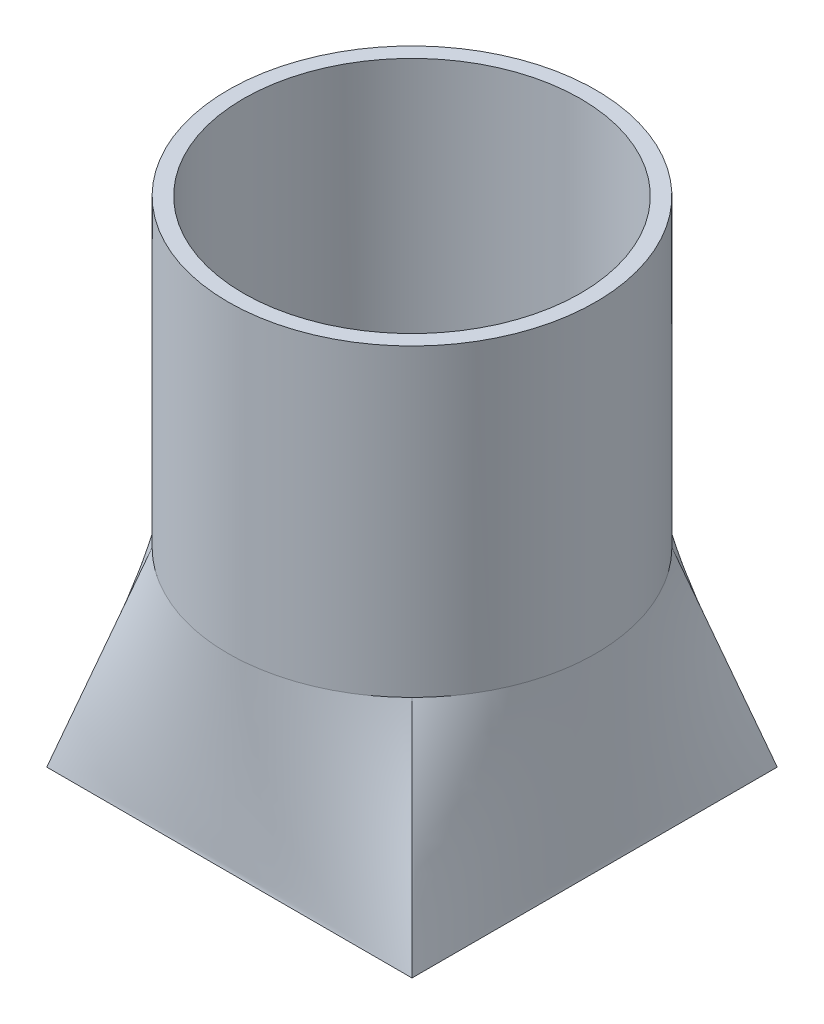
ISO-10303-21;
HEADER;
FILE_DESCRIPTION(('STEP AP214'),'2;1');
FILE_NAME('part.step','',(''),(''),'','','');
FILE_SCHEMA(('AUTOMOTIVE_DESIGN { 1 0 10303 214 1 1 1 1 }'));
ENDSEC;
DATA;
#1=APPLICATION_CONTEXT('core data for automotive mechanical design processes');
#2=APPLICATION_PROTOCOL_DEFINITION('international standard','automotive_design',2000,#1);
#3=PRODUCT_CONTEXT('',#1,'mechanical');
#4=PRODUCT('Part','Part','',(#3));
#5=PRODUCT_RELATED_PRODUCT_CATEGORY('part','',(#4));
#6=PRODUCT_DEFINITION_FORMATION('','',#4);
#7=PRODUCT_DEFINITION_CONTEXT('part definition',#1,'design');
#8=PRODUCT_DEFINITION('design','',#6,#7);
#9=PRODUCT_DEFINITION_SHAPE('','',#8);
#10=(LENGTH_UNIT() NAMED_UNIT(*) SI_UNIT(.MILLI.,.METRE.));
#11=(NAMED_UNIT(*) PLANE_ANGLE_UNIT() SI_UNIT($,.RADIAN.));
#12=(NAMED_UNIT(*) SI_UNIT($,.STERADIAN.) SOLID_ANGLE_UNIT());
#13=UNCERTAINTY_MEASURE_WITH_UNIT(LENGTH_MEASURE(1.E-05),#10,'distance_accuracy_value','');
#14=(GEOMETRIC_REPRESENTATION_CONTEXT(3) GLOBAL_UNCERTAINTY_ASSIGNED_CONTEXT((#13)) GLOBAL_UNIT_ASSIGNED_CONTEXT((#10,
#11,#12)) REPRESENTATION_CONTEXT('',''));
#15=CARTESIAN_POINT('',(0.,0.,0.));
#16=DIRECTION('',(0.,0.,1.));
#17=DIRECTION('',(1.,0.,0.));
#18=AXIS2_PLACEMENT_3D('',#15,#16,#17);
#19=CARTESIAN_POINT('',(15.02597276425,25.5,-16.01198819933));
#20=CARTESIAN_POINT('',(17.39623038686,16.83333333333,-18.34621443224));
#21=CARTESIAN_POINT('',(19.76648800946,8.166666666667,-20.68044066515));
#22=CARTESIAN_POINT('',(22.13674563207,-0.5,-23.01466689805));
#23=CARTESIAN_POINT('',(15.19844188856,25.5,-15.85589557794));
#24=CARTESIAN_POINT('',(17.51008255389,16.83333333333,-18.14347790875));
#25=CARTESIAN_POINT('',(19.82172321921,8.166666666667,-20.43106023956));
#26=CARTESIAN_POINT('',(22.13336388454,-0.5,-22.71864257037));
#27=CARTESIAN_POINT('',(17.49266017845,25.5,-13.71226236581));
#28=CARTESIAN_POINT('',(19.02456652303,16.83333333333,-15.38251742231));
#29=CARTESIAN_POINT('',(20.55647286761,8.166666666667,-17.05277247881));
#30=CARTESIAN_POINT('',(22.08837921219,-0.5,-18.72302753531));
#31=CARTESIAN_POINT('',(20.97659178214,25.5,-8.651253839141));
#32=CARTESIAN_POINT('',(21.32441679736,16.83333333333,-9.449520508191));
#33=CARTESIAN_POINT('',(21.67224181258,8.166666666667,-10.24778717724));
#34=CARTESIAN_POINT('',(22.0200668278,-0.5,-11.04605384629));
#35=CARTESIAN_POINT('',(22.74120410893,25.5,0.));
#36=CARTESIAN_POINT('',(22.48929160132,16.83333333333,0.));
#37=CARTESIAN_POINT('',(22.23737909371,8.166666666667,0.));
#38=CARTESIAN_POINT('',(21.9854665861,-0.5,0.));
#39=CARTESIAN_POINT('',(20.97659178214,25.5,8.651253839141));
#40=CARTESIAN_POINT('',(21.32441679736,16.83333333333,9.449520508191));
#41=CARTESIAN_POINT('',(21.67224181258,8.166666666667,10.24778717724));
#42=CARTESIAN_POINT('',(22.0200668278,-0.5,11.04605384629));
#43=CARTESIAN_POINT('',(17.49266017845,25.5,13.71226236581));
#44=CARTESIAN_POINT('',(19.02456652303,16.83333333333,15.38251742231));
#45=CARTESIAN_POINT('',(20.55647286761,8.166666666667,17.05277247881));
#46=CARTESIAN_POINT('',(22.08837921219,-0.5,18.72302753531));
#47=CARTESIAN_POINT('',(15.19844188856,25.5,15.85589557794));
#48=CARTESIAN_POINT('',(17.51008255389,16.83333333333,18.14347790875));
#49=CARTESIAN_POINT('',(19.82172321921,8.166666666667,20.43106023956));
#50=CARTESIAN_POINT('',(22.13336388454,-0.5,22.71864257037));
#51=CARTESIAN_POINT('',(15.02597276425,25.5,16.01198819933));
#52=CARTESIAN_POINT('',(17.39623038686,16.83333333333,18.34621443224));
#53=CARTESIAN_POINT('',(19.76648800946,8.166666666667,20.68044066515));
#54=CARTESIAN_POINT('',(22.13674563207,-0.5,23.01466689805));
#55=B_SPLINE_SURFACE_WITH_KNOTS('',3,3,((#19,#20,#21,#22),(#23,#24,#25,#26),(#27,#28,#29,#30),
(#31,#32,#33,#34),(#35,#36,#37,#38),(#39,#40,#41,#42),(#43,#44,#45,#46),(#47,#48,#49,#50),(#51,
#52,#53,#54)),.UNSPECIFIED.,.F.,.F.,.F.,(4,1,1,1,1,1,4),(4,4),(-0.02,0.,0.25,0.5,0.75,1.,1.02),
(-0.02000000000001,1.02),.UNSPECIFIED.);
#56=CARTESIAN_POINT('',(15.1627183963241,24.9999999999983,16.1466550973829));
#57=CARTESIAN_POINT('',(15.3318057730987,24.9999999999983,15.987871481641));
#58=CARTESIAN_POINT('',(17.5810393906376,24.9999999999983,13.8086232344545));
#59=CARTESIAN_POINT('',(20.9966586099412,24.9999999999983,8.69730768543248));
#60=CARTESIAN_POINT('',(22.7266706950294,24.9999999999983,0.));
#61=CARTESIAN_POINT('',(20.9966586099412,24.9999999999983,-8.69730768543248));
#62=CARTESIAN_POINT('',(17.5810393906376,24.9999999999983,-13.8086232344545));
#63=CARTESIAN_POINT('',(15.3318057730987,24.9999999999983,-15.987871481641));
#64=CARTESIAN_POINT('',(15.1627183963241,24.9999999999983,-16.1466550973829));
#65=B_SPLINE_CURVE_WITH_KNOTS('',3,(#56,#57,#58,#59,#60,#61,#62,#63,#64),.UNSPECIFIED.,.F.,.F.,
(4,1,1,1,1,1,4),(-0.02,0.,0.25,0.5,0.75,1.,1.02),.UNSPECIFIED.);
#66=CARTESIAN_POINT('',(22.0518515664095,24.9999999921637,-2.07886956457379));
#67=VERTEX_POINT('',#66);
#68=CARTESIAN_POINT('',(15.6624152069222,24.9999999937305,-15.6624152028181));
#69=VERTEX_POINT('',#68);
#70=EDGE_CURVE('E259',#67,#69,#65,.T.);
#71=DIRECTION('',(0.238631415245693,-0.941334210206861,-0.238631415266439));
#72=VECTOR('',#71,1.);
#73=CARTESIAN_POINT('',(18.8312076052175,12.4999999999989,-18.8312076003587));
#74=LINE('',#73,#72);
#75=CARTESIAN_POINT('',(22.0000000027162,3.99285639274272E-10,-21.9999999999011));
#76=VERTEX_POINT('',#75);
#77=EDGE_CURVE('E437',#69,#76,#74,.T.);
#78=DIRECTION('',(0.,0.,1.));
#79=VECTOR('',#78,1.);
#80=CARTESIAN_POINT('',(22.,0.,0.));
#81=LINE('',#80,#79);
#82=CARTESIAN_POINT('',(22.000000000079,-1.80628660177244E-10,22.0000000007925));
#83=VERTEX_POINT('',#82);
#84=EDGE_CURVE('E143',#76,#83,#81,.T.);
#85=DIRECTION('',(-0.238631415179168,0.941334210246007,-0.238631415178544));
#86=VECTOR('',#85,1.);
#87=CARTESIAN_POINT('',(18.831207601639,12.5000000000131,18.8312076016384));
#88=LINE('',#87,#86);
#89=CARTESIAN_POINT('',(15.6624152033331,24.9999999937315,15.6624152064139));
#90=VERTEX_POINT('',#89);
#91=EDGE_CURVE('E136',#83,#90,#88,.T.);
#92=CARTESIAN_POINT('',(15.1627184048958,24.9999999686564,16.1466551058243));
#93=CARTESIAN_POINT('',(15.3318057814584,24.9999999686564,15.9878714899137));
#94=CARTESIAN_POINT('',(17.5810393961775,24.9999999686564,13.8086232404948));
#95=CARTESIAN_POINT('',(20.9966586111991,24.9999999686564,8.69730768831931));
#96=CARTESIAN_POINT('',(22.7266706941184,24.9999999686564,0.));
#97=CARTESIAN_POINT('',(20.9966586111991,24.9999999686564,-8.69730768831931));
#98=CARTESIAN_POINT('',(17.5810393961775,24.9999999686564,-13.8086232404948));
#99=CARTESIAN_POINT('',(15.3318057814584,24.9999999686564,-15.9878714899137));
#100=CARTESIAN_POINT('',(15.1627184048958,24.9999999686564,-16.1466551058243));
#101=B_SPLINE_CURVE_WITH_KNOTS('',3,(#92,#93,#94,#95,#96,#97,#98,#99,#100),.UNSPECIFIED.,.F.,
.F.,(4,1,1,1,1,1,4),(-0.02,0.,0.25,0.5,0.75,1.,1.02),.UNSPECIFIED.);
#102=CARTESIAN_POINT('',(22.05185156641,24.9999999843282,2.07886956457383));
#103=VERTEX_POINT('',#102);
#104=EDGE_CURVE('E139',#90,#103,#101,.T.);
#105=CARTESIAN_POINT('',(15.1627184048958,24.9999999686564,16.1466551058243));
#106=CARTESIAN_POINT('',(15.3318057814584,24.9999999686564,15.9878714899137));
#107=CARTESIAN_POINT('',(17.5810393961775,24.9999999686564,13.8086232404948));
#108=CARTESIAN_POINT('',(20.9966586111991,24.9999999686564,8.69730768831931));
#109=CARTESIAN_POINT('',(22.7266706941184,24.9999999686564,0.));
#110=CARTESIAN_POINT('',(20.9966586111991,24.9999999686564,-8.69730768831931));
#111=CARTESIAN_POINT('',(17.5810393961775,24.9999999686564,-13.8086232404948));
#112=CARTESIAN_POINT('',(15.3318057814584,24.9999999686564,-15.9878714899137));
#113=CARTESIAN_POINT('',(15.1627184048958,24.9999999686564,-16.1466551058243));
#114=B_SPLINE_CURVE_WITH_KNOTS('',3,(#105,#106,#107,#108,#109,#110,#111,#112,#113),
.UNSPECIFIED.,.F.,.F.,(4,1,1,1,1,1,4),(-0.02,0.,0.25,0.5,0.75,1.,1.02),.UNSPECIFIED.);
#115=EDGE_CURVE('E162',#103,#67,#114,.T.);
#116=ORIENTED_EDGE('',*,*,#70,.T.);
#117=ORIENTED_EDGE('',*,*,#77,.T.);
#118=ORIENTED_EDGE('',*,*,#84,.T.);
#119=ORIENTED_EDGE('',*,*,#91,.T.);
#120=ORIENTED_EDGE('',*,*,#104,.T.);
#121=ORIENTED_EDGE('',*,*,#115,.T.);
#122=EDGE_LOOP('',(#116,#117,#118,#119,#120,#121));
#123=FACE_BOUND('',#122,.T.);
#124=ADVANCED_FACE('F17',(#123),#55,.F.);
#125=CARTESIAN_POINT('',(16.01198819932,25.50000000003,15.02597276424));
#126=CARTESIAN_POINT('',(18.34621443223,16.83333333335,17.39623038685));
#127=CARTESIAN_POINT('',(20.68044066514,8.166666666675,19.76648800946));
#128=CARTESIAN_POINT('',(23.01466689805,-0.5000000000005,22.13674563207));
#129=CARTESIAN_POINT('',(15.85589557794,25.50000000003,15.19844188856));
#130=CARTESIAN_POINT('',(18.14347790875,16.83333333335,17.51008255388));
#131=CARTESIAN_POINT('',(20.43106023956,8.166666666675,19.82172321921));
#132=CARTESIAN_POINT('',(22.71864257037,-0.5000000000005,22.13336388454));
#133=CARTESIAN_POINT('',(13.7122623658,25.50000000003,17.49266017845));
#134=CARTESIAN_POINT('',(15.3825174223,16.83333333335,19.02456652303));
#135=CARTESIAN_POINT('',(17.05277247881,8.166666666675,20.55647286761));
#136=CARTESIAN_POINT('',(18.72302753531,-0.5000000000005,22.08837921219));
#137=CARTESIAN_POINT('',(8.651253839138,25.50000000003,20.97659178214));
#138=CARTESIAN_POINT('',(9.449520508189,16.83333333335,21.32441679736));
#139=CARTESIAN_POINT('',(10.24778717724,8.166666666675,21.67224181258));
#140=CARTESIAN_POINT('',(11.04605384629,-0.5000000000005,22.0200668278));
#141=CARTESIAN_POINT('',(0.,25.50000000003,22.74120410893));
#142=CARTESIAN_POINT('',(0.,16.83333333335,22.48929160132));
#143=CARTESIAN_POINT('',(0.,8.166666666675,22.23737909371));
#144=CARTESIAN_POINT('',(0.,-0.5000000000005,21.9854665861));
#145=CARTESIAN_POINT('',(-8.651253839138,25.50000000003,20.97659178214));
#146=CARTESIAN_POINT('',(-9.449520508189,16.83333333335,21.32441679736));
#147=CARTESIAN_POINT('',(-10.24778717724,8.166666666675,21.67224181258));
#148=CARTESIAN_POINT('',(-11.04605384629,-0.5000000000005,22.0200668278));
#149=CARTESIAN_POINT('',(-13.7122623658,25.50000000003,17.49266017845));
#150=CARTESIAN_POINT('',(-15.3825174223,16.83333333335,19.02456652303));
#151=CARTESIAN_POINT('',(-17.05277247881,8.166666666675,20.55647286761));
#152=CARTESIAN_POINT('',(-18.72302753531,-0.5000000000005,22.08837921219));
#153=CARTESIAN_POINT('',(-15.85589557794,25.50000000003,15.19844188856));
#154=CARTESIAN_POINT('',(-18.14347790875,16.83333333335,17.51008255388));
#155=CARTESIAN_POINT('',(-20.43106023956,8.166666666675,19.82172321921));
#156=CARTESIAN_POINT('',(-22.71864257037,-0.5000000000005,22.13336388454));
#157=CARTESIAN_POINT('',(-16.01198819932,25.50000000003,15.02597276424));
#158=CARTESIAN_POINT('',(-18.34621443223,16.83333333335,17.39623038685));
#159=CARTESIAN_POINT('',(-20.68044066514,8.166666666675,19.76648800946));
#160=CARTESIAN_POINT('',(-23.01466689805,-0.5000000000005,22.13674563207));
#161=B_SPLINE_SURFACE_WITH_KNOTS('',3,3,((#125,#126,#127,#128),(#129,#130,#131,#132),(#133,#134,
#135,#136),(#137,#138,#139,#140),(#141,#142,#143,#144),(#145,#146,#147,#148),(#149,#150,#151,
#152),(#153,#154,#155,#156),(#157,#158,#159,#160)),.UNSPECIFIED.,.F.,.F.,.F.,(4,1,1,1,1,1,4),(4,
4),(-0.02,0.,0.25,0.5,0.75,1.,1.02),(-0.0200000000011,1.02),.UNSPECIFIED.);
#162=CARTESIAN_POINT('',(-16.1466551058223,24.9999999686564,15.1627184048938));
#163=CARTESIAN_POINT('',(-15.9878714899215,24.9999999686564,15.3318057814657));
#164=CARTESIAN_POINT('',(-13.8086232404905,24.9999999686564,17.5810393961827));
#165=CARTESIAN_POINT('',(-8.69730768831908,24.9999999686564,20.9966586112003));
#166=CARTESIAN_POINT('',(0.,24.9999999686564,22.7266706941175));
#167=CARTESIAN_POINT('',(8.69730768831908,24.9999999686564,20.9966586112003));
#168=CARTESIAN_POINT('',(13.8086232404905,24.9999999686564,17.5810393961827));
#169=CARTESIAN_POINT('',(15.9878714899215,24.9999999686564,15.3318057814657));
#170=CARTESIAN_POINT('',(16.1466551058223,24.9999999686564,15.1627184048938));
#171=B_SPLINE_CURVE_WITH_KNOTS('',3,(#162,#163,#164,#165,#166,#167,#168,#169,#170),
.UNSPECIFIED.,.F.,.F.,(4,1,1,1,1,1,4),(-0.02,0.,0.25,0.5,0.75,1.,1.02),.UNSPECIFIED.);
#172=CARTESIAN_POINT('',(0.,24.9999999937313,22.1499999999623));
#173=VERTEX_POINT('',#172);
#174=CARTESIAN_POINT('',(2.07886956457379,24.9999999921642,22.0518515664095));
#175=VERTEX_POINT('',#174);
#176=EDGE_CURVE('E153',#173,#175,#171,.T.);
#177=CARTESIAN_POINT('',(-16.1466550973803,25.0000000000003,15.1627183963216));
#178=CARTESIAN_POINT('',(-15.9878714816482,25.0000000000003,15.3318057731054));
#179=CARTESIAN_POINT('',(-13.8086232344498,25.0000000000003,17.5810393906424));
#180=CARTESIAN_POINT('',(-8.69730768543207,25.0000000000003,20.9966586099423));
#181=CARTESIAN_POINT('',(0.,25.0000000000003,22.7266706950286));
#182=CARTESIAN_POINT('',(8.69730768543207,25.0000000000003,20.9966586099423));
#183=CARTESIAN_POINT('',(13.8086232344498,25.0000000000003,17.5810393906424));
#184=CARTESIAN_POINT('',(15.9878714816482,25.0000000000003,15.3318057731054));
#185=CARTESIAN_POINT('',(16.1466550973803,25.0000000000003,15.1627183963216));
#186=B_SPLINE_CURVE_WITH_KNOTS('',3,(#177,#178,#179,#180,#181,#182,#183,#184,#185),
.UNSPECIFIED.,.F.,.F.,(4,1,1,1,1,1,4),(-0.02,0.,0.25,0.5,0.75,1.,1.02),.UNSPECIFIED.);
#187=EDGE_CURVE('E149',#175,#90,#186,.T.);
#188=DIRECTION('',(1.,0.,0.));
#189=VECTOR('',#188,1.);
#190=CARTESIAN_POINT('',(0.,0.,22.));
#191=LINE('',#190,#189);
#192=CARTESIAN_POINT('',(-22.0000000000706,-2.69154490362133E-10,22.0000000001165));
#193=VERTEX_POINT('',#192);
#194=EDGE_CURVE('E289',#83,#193,#191,.F.);
#195=DIRECTION('',(0.238631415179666,0.941334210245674,-0.238631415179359));
#196=VECTOR('',#195,1.);
#197=CARTESIAN_POINT('',(-18.8312076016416,12.4999999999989,18.8312076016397));
#198=LINE('',#197,#196);
#199=CARTESIAN_POINT('',(-15.6624152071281,24.9999999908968,15.6624152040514));
#200=VERTEX_POINT('',#199);
#201=EDGE_CURVE('E146',#193,#200,#198,.T.);
#202=CARTESIAN_POINT('',(-16.1466551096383,24.9999999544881,15.1627184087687));
#203=CARTESIAN_POINT('',(-15.9878714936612,24.9999999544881,15.3318057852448));
#204=CARTESIAN_POINT('',(-13.808623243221,24.9999999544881,17.5810393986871));
#205=CARTESIAN_POINT('',(-8.69730768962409,24.9999999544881,20.9966586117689));
#206=CARTESIAN_POINT('',(0.,24.9999999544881,22.7266706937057));
#207=CARTESIAN_POINT('',(8.69730768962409,24.9999999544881,20.9966586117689));
#208=CARTESIAN_POINT('',(13.808623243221,24.9999999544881,17.5810393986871));
#209=CARTESIAN_POINT('',(15.9878714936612,24.9999999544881,15.3318057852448));
#210=CARTESIAN_POINT('',(16.1466551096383,24.9999999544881,15.1627184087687));
#211=B_SPLINE_CURVE_WITH_KNOTS('',3,(#202,#203,#204,#205,#206,#207,#208,#209,#210),
.UNSPECIFIED.,.F.,.F.,(4,1,1,1,1,1,4),(-0.02,0.,0.25,0.5,0.75,1.,1.02),.UNSPECIFIED.);
#212=CARTESIAN_POINT('',(-2.08209439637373,24.999999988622,22.0515465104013));
#213=VERTEX_POINT('',#212);
#214=EDGE_CURVE('E502',#200,#213,#211,.T.);
#215=CARTESIAN_POINT('',(-16.1466550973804,25.,15.1627183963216));
#216=CARTESIAN_POINT('',(-15.9878714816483,25.,15.3318057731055));
#217=CARTESIAN_POINT('',(-13.8086232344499,25.,17.5810393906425));
#218=CARTESIAN_POINT('',(-8.69730768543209,25.,20.9966586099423));
#219=CARTESIAN_POINT('',(0.,25.,22.7266706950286));
#220=CARTESIAN_POINT('',(8.69730768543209,25.,20.9966586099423));
#221=CARTESIAN_POINT('',(13.8086232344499,25.,17.5810393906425));
#222=CARTESIAN_POINT('',(15.9878714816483,25.,15.3318057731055));
#223=CARTESIAN_POINT('',(16.1466550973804,25.,15.1627183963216));
#224=B_SPLINE_CURVE_WITH_KNOTS('',3,(#215,#216,#217,#218,#219,#220,#221,#222,#223),
.UNSPECIFIED.,.F.,.F.,(4,1,1,1,1,1,4),(-0.02,0.,0.25,0.5,0.75,1.,1.02),.UNSPECIFIED.);
#225=EDGE_CURVE('E421',#213,#173,#224,.T.);
#226=ORIENTED_EDGE('',*,*,#176,.T.);
#227=ORIENTED_EDGE('',*,*,#187,.T.);
#228=ORIENTED_EDGE('',*,*,#91,.F.);
#229=ORIENTED_EDGE('',*,*,#194,.T.);
#230=ORIENTED_EDGE('',*,*,#201,.T.);
#231=ORIENTED_EDGE('',*,*,#214,.T.);
#232=ORIENTED_EDGE('',*,*,#225,.T.);
#233=EDGE_LOOP('',(#226,#227,#228,#229,#230,#231,#232));
#234=FACE_BOUND('',#233,.T.);
#235=ADVANCED_FACE('F151',(#234),#161,.F.);
#236=CARTESIAN_POINT('',(-15.02597276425,25.5,16.01198819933));
#237=CARTESIAN_POINT('',(-17.39623038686,16.83333333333,18.34621443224));
#238=CARTESIAN_POINT('',(-19.76648800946,8.166666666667,20.68044066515));
#239=CARTESIAN_POINT('',(-22.13674563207,-0.5,23.01466689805));
#240=CARTESIAN_POINT('',(-15.19844188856,25.5,15.85589557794));
#241=CARTESIAN_POINT('',(-17.51008255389,16.83333333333,18.14347790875));
#242=CARTESIAN_POINT('',(-19.82172321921,8.166666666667,20.43106023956));
#243=CARTESIAN_POINT('',(-22.13336388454,-0.5,22.71864257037));
#244=CARTESIAN_POINT('',(-17.49266017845,25.5,13.71226236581));
#245=CARTESIAN_POINT('',(-19.02456652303,16.83333333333,15.38251742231));
#246=CARTESIAN_POINT('',(-20.55647286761,8.166666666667,17.05277247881));
#247=CARTESIAN_POINT('',(-22.08837921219,-0.5,18.72302753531));
#248=CARTESIAN_POINT('',(-20.97659178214,25.5,8.651253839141));
#249=CARTESIAN_POINT('',(-21.32441679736,16.83333333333,9.449520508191));
#250=CARTESIAN_POINT('',(-21.67224181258,8.166666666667,10.24778717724));
#251=CARTESIAN_POINT('',(-22.0200668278,-0.5,11.04605384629));
#252=CARTESIAN_POINT('',(-22.74120410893,25.5,0.));
#253=CARTESIAN_POINT('',(-22.48929160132,16.83333333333,0.));
#254=CARTESIAN_POINT('',(-22.23737909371,8.166666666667,0.));
#255=CARTESIAN_POINT('',(-21.9854665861,-0.5,0.));
#256=CARTESIAN_POINT('',(-20.97659178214,25.5,-8.651253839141));
#257=CARTESIAN_POINT('',(-21.32441679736,16.83333333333,-9.449520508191));
#258=CARTESIAN_POINT('',(-21.67224181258,8.166666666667,-10.24778717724));
#259=CARTESIAN_POINT('',(-22.0200668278,-0.5,-11.04605384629));
#260=CARTESIAN_POINT('',(-17.49266017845,25.5,-13.71226236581));
#261=CARTESIAN_POINT('',(-19.02456652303,16.83333333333,-15.38251742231));
#262=CARTESIAN_POINT('',(-20.55647286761,8.166666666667,-17.05277247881));
#263=CARTESIAN_POINT('',(-22.08837921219,-0.5,-18.72302753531));
#264=CARTESIAN_POINT('',(-15.19844188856,25.5,-15.85589557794));
#265=CARTESIAN_POINT('',(-17.51008255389,16.83333333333,-18.14347790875));
#266=CARTESIAN_POINT('',(-19.82172321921,8.166666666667,-20.43106023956));
#267=CARTESIAN_POINT('',(-22.13336388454,-0.5,-22.71864257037));
#268=CARTESIAN_POINT('',(-15.02597276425,25.5,-16.01198819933));
#269=CARTESIAN_POINT('',(-17.39623038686,16.83333333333,-18.34621443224));
#270=CARTESIAN_POINT('',(-19.76648800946,8.166666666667,-20.68044066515));
#271=CARTESIAN_POINT('',(-22.13674563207,-0.5,-23.01466689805));
#272=B_SPLINE_SURFACE_WITH_KNOTS('',3,3,((#236,#237,#238,#239),(#240,#241,#242,#243),(#244,#245,
#246,#247),(#248,#249,#250,#251),(#252,#253,#254,#255),(#256,#257,#258,#259),(#260,#261,#262,
#263),(#264,#265,#266,#267),(#268,#269,#270,#271)),.UNSPECIFIED.,.F.,.F.,.F.,(4,1,1,1,1,1,4),(4,
4),(-0.02,0.,0.25,0.5,0.75,1.,1.02),(-0.02,1.02),.UNSPECIFIED.);
#273=CARTESIAN_POINT('',(-15.1627183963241,24.9999999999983,-16.1466550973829));
#274=CARTESIAN_POINT('',(-15.3318057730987,24.9999999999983,-15.987871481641));
#275=CARTESIAN_POINT('',(-17.5810393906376,24.9999999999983,-13.8086232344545));
#276=CARTESIAN_POINT('',(-20.9966586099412,24.9999999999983,-8.69730768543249));
#277=CARTESIAN_POINT('',(-22.7266706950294,24.9999999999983,0.));
#278=CARTESIAN_POINT('',(-20.9966586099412,24.9999999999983,8.69730768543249));
#279=CARTESIAN_POINT('',(-17.5810393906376,24.9999999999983,13.8086232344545));
#280=CARTESIAN_POINT('',(-15.3318057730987,24.9999999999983,15.987871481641));
#281=CARTESIAN_POINT('',(-15.1627183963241,24.9999999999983,16.1466550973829));
#282=B_SPLINE_CURVE_WITH_KNOTS('',3,(#273,#274,#275,#276,#277,#278,#279,#280,#281),
.UNSPECIFIED.,.F.,.F.,(4,1,1,1,1,1,4),(-0.02,0.,0.25,0.5,0.75,1.,1.02),.UNSPECIFIED.);
#283=CARTESIAN_POINT('',(-22.0518515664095,24.9999999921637,2.07886956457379));
#284=VERTEX_POINT('',#283);
#285=EDGE_CURVE('E500',#284,#200,#282,.T.);
#286=DIRECTION('',(0.,0.,1.));
#287=VECTOR('',#286,1.);
#288=CARTESIAN_POINT('',(-22.,0.,0.));
#289=LINE('',#288,#287);
#290=CARTESIAN_POINT('',(-22.000000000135,-5.38185815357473E-10,-22.0000000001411));
#291=VERTEX_POINT('',#290);
#292=EDGE_CURVE('E281',#193,#291,#289,.F.);
#293=DIRECTION('',(0.23863141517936,0.941334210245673,0.238631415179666));
#294=VECTOR('',#293,1.);
#295=CARTESIAN_POINT('',(-18.8312076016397,12.4999999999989,-18.8312076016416));
#296=LINE('',#295,#294);
#297=CARTESIAN_POINT('',(-15.6624152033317,24.9999999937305,-15.6624152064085));
#298=VERTEX_POINT('',#297);
#299=EDGE_CURVE('E164',#291,#298,#296,.T.);
#300=CARTESIAN_POINT('',(-15.1627184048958,24.9999999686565,-16.1466551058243));
#301=CARTESIAN_POINT('',(-15.3318057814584,24.9999999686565,-15.9878714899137));
#302=CARTESIAN_POINT('',(-17.5810393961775,24.9999999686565,-13.8086232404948));
#303=CARTESIAN_POINT('',(-20.9966586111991,24.9999999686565,-8.69730768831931));
#304=CARTESIAN_POINT('',(-22.7266706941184,24.9999999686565,0.));
#305=CARTESIAN_POINT('',(-20.9966586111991,24.9999999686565,8.69730768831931));
#306=CARTESIAN_POINT('',(-17.5810393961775,24.9999999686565,13.8086232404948));
#307=CARTESIAN_POINT('',(-15.3318057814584,24.9999999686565,15.9878714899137));
#308=CARTESIAN_POINT('',(-15.1627184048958,24.9999999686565,16.1466551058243));
#309=B_SPLINE_CURVE_WITH_KNOTS('',3,(#300,#301,#302,#303,#304,#305,#306,#307,#308),
.UNSPECIFIED.,.F.,.F.,(4,1,1,1,1,1,4),(-0.02,0.,0.25,0.5,0.75,1.,1.02),.UNSPECIFIED.);
#310=CARTESIAN_POINT('',(-22.05185156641,24.9999999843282,-2.07886956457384));
#311=VERTEX_POINT('',#310);
#312=EDGE_CURVE('E499',#298,#311,#309,.T.);
#313=CARTESIAN_POINT('',(-15.1627184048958,24.9999999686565,-16.1466551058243));
#314=CARTESIAN_POINT('',(-15.3318057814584,24.9999999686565,-15.9878714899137));
#315=CARTESIAN_POINT('',(-17.5810393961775,24.9999999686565,-13.8086232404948));
#316=CARTESIAN_POINT('',(-20.9966586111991,24.9999999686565,-8.69730768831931));
#317=CARTESIAN_POINT('',(-22.7266706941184,24.9999999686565,0.));
#318=CARTESIAN_POINT('',(-20.9966586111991,24.9999999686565,8.69730768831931));
#319=CARTESIAN_POINT('',(-17.5810393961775,24.9999999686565,13.8086232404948));
#320=CARTESIAN_POINT('',(-15.3318057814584,24.9999999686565,15.9878714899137));
#321=CARTESIAN_POINT('',(-15.1627184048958,24.9999999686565,16.1466551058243));
#322=B_SPLINE_CURVE_WITH_KNOTS('',3,(#313,#314,#315,#316,#317,#318,#319,#320,#321),
.UNSPECIFIED.,.F.,.F.,(4,1,1,1,1,1,4),(-0.02,0.,0.25,0.5,0.75,1.,1.02),.UNSPECIFIED.);
#323=EDGE_CURVE('E498',#311,#284,#322,.T.);
#324=ORIENTED_EDGE('',*,*,#285,.T.);
#325=ORIENTED_EDGE('',*,*,#201,.F.);
#326=ORIENTED_EDGE('',*,*,#292,.T.);
#327=ORIENTED_EDGE('',*,*,#299,.T.);
#328=ORIENTED_EDGE('',*,*,#312,.T.);
#329=ORIENTED_EDGE('',*,*,#323,.T.);
#330=EDGE_LOOP('',(#324,#325,#326,#327,#328,#329));
#331=FACE_BOUND('',#330,.T.);
#332=ADVANCED_FACE('F452',(#331),#272,.F.);
#333=CARTESIAN_POINT('',(-16.01198819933,25.5,-15.02597276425));
#334=CARTESIAN_POINT('',(-18.34621443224,16.83333333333,-17.39623038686));
#335=CARTESIAN_POINT('',(-20.68044066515,8.166666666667,-19.76648800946));
#336=CARTESIAN_POINT('',(-23.01466689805,-0.5,-22.13674563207));
#337=CARTESIAN_POINT('',(-15.85589557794,25.5,-15.19844188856));
#338=CARTESIAN_POINT('',(-18.14347790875,16.83333333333,-17.51008255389));
#339=CARTESIAN_POINT('',(-20.43106023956,8.166666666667,-19.82172321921));
#340=CARTESIAN_POINT('',(-22.71864257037,-0.5,-22.13336388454));
#341=CARTESIAN_POINT('',(-13.71226236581,25.5,-17.49266017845));
#342=CARTESIAN_POINT('',(-15.38251742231,16.83333333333,-19.02456652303));
#343=CARTESIAN_POINT('',(-17.05277247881,8.166666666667,-20.55647286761));
#344=CARTESIAN_POINT('',(-18.72302753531,-0.5,-22.08837921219));
#345=CARTESIAN_POINT('',(-8.65125383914,25.5,-20.97659178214));
#346=CARTESIAN_POINT('',(-9.449520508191,16.83333333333,-21.32441679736));
#347=CARTESIAN_POINT('',(-10.24778717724,8.166666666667,-21.67224181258));
#348=CARTESIAN_POINT('',(-11.04605384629,-0.5,-22.0200668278));
#349=CARTESIAN_POINT('',(0.,25.5,-22.74120410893));
#350=CARTESIAN_POINT('',(0.,16.83333333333,-22.48929160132));
#351=CARTESIAN_POINT('',(0.,8.166666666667,-22.23737909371));
#352=CARTESIAN_POINT('',(0.,-0.5,-21.9854665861));
#353=CARTESIAN_POINT('',(8.65125383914,25.5,-20.97659178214));
#354=CARTESIAN_POINT('',(9.449520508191,16.83333333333,-21.32441679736));
#355=CARTESIAN_POINT('',(10.24778717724,8.166666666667,-21.67224181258));
#356=CARTESIAN_POINT('',(11.04605384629,-0.5,-22.0200668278));
#357=CARTESIAN_POINT('',(13.71226236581,25.5,-17.49266017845));
#358=CARTESIAN_POINT('',(15.38251742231,16.83333333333,-19.02456652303));
#359=CARTESIAN_POINT('',(17.05277247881,8.166666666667,-20.55647286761));
#360=CARTESIAN_POINT('',(18.72302753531,-0.5,-22.08837921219));
#361=CARTESIAN_POINT('',(15.85589557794,25.5,-15.19844188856));
#362=CARTESIAN_POINT('',(18.14347790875,16.83333333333,-17.51008255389));
#363=CARTESIAN_POINT('',(20.43106023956,8.166666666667,-19.82172321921));
#364=CARTESIAN_POINT('',(22.71864257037,-0.5,-22.13336388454));
#365=CARTESIAN_POINT('',(16.01198819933,25.5,-15.02597276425));
#366=CARTESIAN_POINT('',(18.34621443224,16.83333333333,-17.39623038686));
#367=CARTESIAN_POINT('',(20.68044066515,8.166666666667,-19.76648800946));
#368=CARTESIAN_POINT('',(23.01466689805,-0.5,-22.13674563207));
#369=B_SPLINE_SURFACE_WITH_KNOTS('',3,3,((#333,#334,#335,#336),(#337,#338,#339,#340),(#341,#342,
#343,#344),(#345,#346,#347,#348),(#349,#350,#351,#352),(#353,#354,#355,#356),(#357,#358,#359,
#360),(#361,#362,#363,#364),(#365,#366,#367,#368)),.UNSPECIFIED.,.F.,.F.,.F.,(4,1,1,1,1,1,4),(4,
4),(-0.02,0.,0.25,0.5,0.75,1.,1.02),(-0.02000000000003,1.02),.UNSPECIFIED.);
#370=DIRECTION('',(1.,0.,0.));
#371=VECTOR('',#370,1.);
#372=CARTESIAN_POINT('',(0.,0.,-22.));
#373=LINE('',#372,#371);
#374=EDGE_CURVE('E288',#291,#76,#373,.T.);
#375=CARTESIAN_POINT('',(16.1466551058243,24.9999999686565,-15.1627184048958));
#376=CARTESIAN_POINT('',(15.9878714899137,24.9999999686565,-15.3318057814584));
#377=CARTESIAN_POINT('',(13.8086232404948,24.9999999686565,-17.5810393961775));
#378=CARTESIAN_POINT('',(8.69730768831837,24.9999999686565,-20.9966586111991));
#379=CARTESIAN_POINT('',(0.,24.9999999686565,-22.7266706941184));
#380=CARTESIAN_POINT('',(-8.69730768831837,24.9999999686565,-20.9966586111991));
#381=CARTESIAN_POINT('',(-13.8086232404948,24.9999999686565,-17.5810393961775));
#382=CARTESIAN_POINT('',(-15.9878714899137,24.9999999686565,-15.3318057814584));
#383=CARTESIAN_POINT('',(-16.1466551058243,24.9999999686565,-15.1627184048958));
#384=B_SPLINE_CURVE_WITH_KNOTS('',3,(#375,#376,#377,#378,#379,#380,#381,#382,#383),
.UNSPECIFIED.,.F.,.F.,(4,1,1,1,1,1,4),(-0.02,0.,0.25,0.5,0.75,1.,1.02),.UNSPECIFIED.);
#385=CARTESIAN_POINT('',(2.07886956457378,24.9999999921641,-22.0518515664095));
#386=VERTEX_POINT('',#385);
#387=EDGE_CURVE('E261',#69,#386,#384,.T.);
#388=CARTESIAN_POINT('',(16.1466550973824,25.,-15.1627183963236));
#389=CARTESIAN_POINT('',(15.9878714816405,25.,-15.3318057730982));
#390=CARTESIAN_POINT('',(13.8086232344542,25.,-17.5810393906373));
#391=CARTESIAN_POINT('',(8.69730768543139,25.,-20.9966586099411));
#392=CARTESIAN_POINT('',(0.,25.,-22.7266706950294));
#393=CARTESIAN_POINT('',(-8.69730768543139,25.,-20.9966586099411));
#394=CARTESIAN_POINT('',(-13.8086232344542,25.,-17.5810393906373));
#395=CARTESIAN_POINT('',(-15.9878714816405,25.,-15.3318057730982));
#396=CARTESIAN_POINT('',(-16.1466550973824,25.,-15.1627183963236));
#397=B_SPLINE_CURVE_WITH_KNOTS('',3,(#388,#389,#390,#391,#392,#393,#394,#395,#396),
.UNSPECIFIED.,.F.,.F.,(4,1,1,1,1,1,4),(-0.02,0.,0.25,0.5,0.75,1.,1.02),.UNSPECIFIED.);
#398=CARTESIAN_POINT('',(0.,24.9999999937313,-22.1499999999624));
#399=VERTEX_POINT('',#398);
#400=EDGE_CURVE('E264',#386,#399,#397,.T.);
#401=CARTESIAN_POINT('',(16.1466551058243,24.9999999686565,-15.1627184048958));
#402=CARTESIAN_POINT('',(15.9878714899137,24.9999999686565,-15.3318057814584));
#403=CARTESIAN_POINT('',(13.8086232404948,24.9999999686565,-17.5810393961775));
#404=CARTESIAN_POINT('',(8.69730768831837,24.9999999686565,-20.9966586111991));
#405=CARTESIAN_POINT('',(0.,24.9999999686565,-22.7266706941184));
#406=CARTESIAN_POINT('',(-8.69730768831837,24.9999999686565,-20.9966586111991));
#407=CARTESIAN_POINT('',(-13.8086232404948,24.9999999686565,-17.5810393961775));
#408=CARTESIAN_POINT('',(-15.9878714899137,24.9999999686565,-15.3318057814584));
#409=CARTESIAN_POINT('',(-16.1466551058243,24.9999999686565,-15.1627184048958));
#410=B_SPLINE_CURVE_WITH_KNOTS('',3,(#401,#402,#403,#404,#405,#406,#407,#408,#409),
.UNSPECIFIED.,.F.,.F.,(4,1,1,1,1,1,4),(-0.02,0.,0.25,0.5,0.75,1.,1.02),.UNSPECIFIED.);
#411=CARTESIAN_POINT('',(-2.07886956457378,24.9999999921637,-22.0518515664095));
#412=VERTEX_POINT('',#411);
#413=EDGE_CURVE('E156',#399,#412,#410,.T.);
#414=CARTESIAN_POINT('',(16.1466550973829,24.9999999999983,-15.1627183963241));
#415=CARTESIAN_POINT('',(15.987871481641,24.9999999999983,-15.3318057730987));
#416=CARTESIAN_POINT('',(13.8086232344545,24.9999999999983,-17.5810393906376));
#417=CARTESIAN_POINT('',(8.69730768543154,24.9999999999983,-20.9966586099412));
#418=CARTESIAN_POINT('',(0.,24.9999999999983,-22.7266706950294));
#419=CARTESIAN_POINT('',(-8.69730768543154,24.9999999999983,-20.9966586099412));
#420=CARTESIAN_POINT('',(-13.8086232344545,24.9999999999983,-17.5810393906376));
#421=CARTESIAN_POINT('',(-15.987871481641,24.9999999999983,-15.3318057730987));
#422=CARTESIAN_POINT('',(-16.1466550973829,24.9999999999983,-15.1627183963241));
#423=B_SPLINE_CURVE_WITH_KNOTS('',3,(#414,#415,#416,#417,#418,#419,#420,#421,#422),
.UNSPECIFIED.,.F.,.F.,(4,1,1,1,1,1,4),(-0.02,0.,0.25,0.5,0.75,1.,1.02),.UNSPECIFIED.);
#424=EDGE_CURVE('E432',#412,#298,#423,.T.);
#425=ORIENTED_EDGE('',*,*,#299,.F.);
#426=ORIENTED_EDGE('',*,*,#374,.T.);
#427=ORIENTED_EDGE('',*,*,#77,.F.);
#428=ORIENTED_EDGE('',*,*,#387,.T.);
#429=ORIENTED_EDGE('',*,*,#400,.T.);
#430=ORIENTED_EDGE('',*,*,#413,.T.);
#431=ORIENTED_EDGE('',*,*,#424,.T.);
#432=EDGE_LOOP('',(#425,#426,#427,#428,#429,#430,#431));
#433=FACE_BOUND('',#432,.T.);
#434=ADVANCED_FACE('F181',(#433),#369,.F.);
#435=CARTESIAN_POINT('',(0.,25.,0.));
#436=DIRECTION('',(0.,1.,0.));
#437=DIRECTION('',(0.,0.,1.));
#438=AXIS2_PLACEMENT_3D('',#435,#436,#437);
#439=CYLINDRICAL_SURFACE('',#438,22.15);
#440=CARTESIAN_POINT('',(0.,65.,0.));
#441=DIRECTION('',(0.,1.,0.));
#442=DIRECTION('',(0.,0.,1.));
#443=AXIS2_PLACEMENT_3D('',#440,#441,#442);
#444=CIRCLE('',#443,22.15);
#445=CARTESIAN_POINT('',(0.,65.,22.15));
#446=VERTEX_POINT('',#445);
#447=EDGE_CURVE('E309',#446,#446,#444,.F.);
#448=ORIENTED_EDGE('',*,*,#447,.F.);
#449=EDGE_LOOP('',(#448));
#450=FACE_BOUND('',#449,.T.);
#451=ORIENTED_EDGE('',*,*,#176,.F.);
#452=ORIENTED_EDGE('',*,*,#225,.F.);
#453=ORIENTED_EDGE('',*,*,#214,.F.);
#454=ORIENTED_EDGE('',*,*,#285,.F.);
#455=ORIENTED_EDGE('',*,*,#323,.F.);
#456=ORIENTED_EDGE('',*,*,#312,.F.);
#457=ORIENTED_EDGE('',*,*,#424,.F.);
#458=ORIENTED_EDGE('',*,*,#413,.F.);
#459=ORIENTED_EDGE('',*,*,#400,.F.);
#460=ORIENTED_EDGE('',*,*,#387,.F.);
#461=ORIENTED_EDGE('',*,*,#70,.F.);
#462=ORIENTED_EDGE('',*,*,#115,.F.);
#463=ORIENTED_EDGE('',*,*,#104,.F.);
#464=ORIENTED_EDGE('',*,*,#187,.F.);
#465=EDGE_LOOP('',(#451,#452,#453,#454,#455,#456,#457,#458,#459,#460,#461,#462,#463,#464));
#466=FACE_BOUND('',#465,.T.);
#467=ADVANCED_FACE('F160',(#450,#466),#439,.F.);
#468=CARTESIAN_POINT('',(-24.14936374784,-0.5,-25.10710815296));
#469=CARTESIAN_POINT('',(-21.56039211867,8.166666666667,-22.55723350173));
#470=CARTESIAN_POINT('',(-18.97142048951,16.83333333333,-20.0073588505));
#471=CARTESIAN_POINT('',(-16.38244886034,25.5,-17.45748419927));
#472=CARTESIAN_POINT('',(-24.14567665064,-0.5,-24.78417056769));
#473=CARTESIAN_POINT('',(-21.62061470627,8.166666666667,-22.28521406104));
#474=CARTESIAN_POINT('',(-19.09555276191,16.83333333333,-19.78625755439));
#475=CARTESIAN_POINT('',(-16.57049081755,25.5,-17.28730104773));
#476=CARTESIAN_POINT('',(-24.09663015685,-0.5,-20.42529096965));
#477=CARTESIAN_POINT('',(-22.42170743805,8.166666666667,-18.60024749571));
#478=CARTESIAN_POINT('',(-20.74678471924,16.83333333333,-16.77520402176));
#479=CARTESIAN_POINT('',(-19.07186200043,25.5,-14.95016054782));
#480=CARTESIAN_POINT('',(-24.02214961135,-0.5,-12.05034764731));
#481=CARTESIAN_POINT('',(-23.63822301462,8.166666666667,-11.17765509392));
#482=CARTESIAN_POINT('',(-23.25429641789,16.83333333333,-10.30496254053));
#483=CARTESIAN_POINT('',(-22.87036982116,25.5,-9.432269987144));
#484=CARTESIAN_POINT('',(-23.98442519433,-0.5,0.));
#485=CARTESIAN_POINT('',(-24.25438849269,8.166666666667,0.));
#486=CARTESIAN_POINT('',(-24.52435179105,16.83333333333,0.));
#487=CARTESIAN_POINT('',(-24.79431508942,25.5,0.));
#488=CARTESIAN_POINT('',(-24.02214961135,-0.5,12.05034764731));
#489=CARTESIAN_POINT('',(-23.63822301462,8.166666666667,11.17765509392));
#490=CARTESIAN_POINT('',(-23.25429641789,16.83333333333,10.30496254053));
#491=CARTESIAN_POINT('',(-22.87036982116,25.5,9.432269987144));
#492=CARTESIAN_POINT('',(-24.09663015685,-0.5,20.42529096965));
#493=CARTESIAN_POINT('',(-22.42170743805,8.166666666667,18.60024749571));
#494=CARTESIAN_POINT('',(-20.74678471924,16.83333333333,16.77520402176));
#495=CARTESIAN_POINT('',(-19.07186200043,25.5,14.95016054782));
#496=CARTESIAN_POINT('',(-24.14567665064,-0.5,24.78417056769));
#497=CARTESIAN_POINT('',(-21.62061470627,8.166666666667,22.28521406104));
#498=CARTESIAN_POINT('',(-19.09555276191,16.83333333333,19.78625755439));
#499=CARTESIAN_POINT('',(-16.57049081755,25.5,17.28730104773));
#500=CARTESIAN_POINT('',(-24.14936374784,-0.5,25.10710815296));
#501=CARTESIAN_POINT('',(-21.56039211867,8.166666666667,22.55723350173));
#502=CARTESIAN_POINT('',(-18.97142048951,16.83333333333,20.0073588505));
#503=CARTESIAN_POINT('',(-16.38244886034,25.5,17.45748419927));
#504=B_SPLINE_SURFACE_WITH_KNOTS('',3,3,((#468,#469,#470,#471),(#472,#473,#474,#475),(#476,#477,
#478,#479),(#480,#481,#482,#483),(#484,#485,#486,#487),(#488,#489,#490,#491),(#492,#493,#494,
#495),(#496,#497,#498,#499),(#500,#501,#502,#503)),.UNSPECIFIED.,.F.,.F.,.F.,(4,1,1,1,1,1,4),(4,
4),(-0.02,0.,0.25,0.5,0.75,1.,1.02),(-0.02,1.02),.UNSPECIFIED.);
#505=CARTESIAN_POINT('',(-16.53181261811,24.999999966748,17.6045923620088));
#506=CARTESIAN_POINT('',(-16.7161674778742,24.999999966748,17.4314716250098));
#507=CARTESIAN_POINT('',(-19.1684921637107,24.999999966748,15.0554515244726));
#508=CARTESIAN_POINT('',(-22.8925194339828,24.999999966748,9.48261763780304));
#509=CARTESIAN_POINT('',(-24.778740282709,24.999999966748,0.));
#510=CARTESIAN_POINT('',(-22.8925194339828,24.999999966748,-9.48261763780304));
#511=CARTESIAN_POINT('',(-19.1684921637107,24.999999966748,-15.0554515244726));
#512=CARTESIAN_POINT('',(-16.7161674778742,24.999999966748,-17.4314716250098));
#513=CARTESIAN_POINT('',(-16.53181261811,24.999999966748,-17.6045923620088));
#514=B_SPLINE_CURVE_WITH_KNOTS('',3,(#505,#506,#507,#508,#509,#510,#511,#512,#513),
.UNSPECIFIED.,.F.,.F.,(4,1,1,1,1,1,4),(-0.02,0.,0.25,0.5,0.75,1.,1.02),.UNSPECIFIED.);
#515=CARTESIAN_POINT('',(-24.0519067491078,24.999999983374,-2.17017551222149));
#516=VERTEX_POINT('',#515);
#517=CARTESIAN_POINT('',(-24.0519067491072,24.9999999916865,2.17017551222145));
#518=VERTEX_POINT('',#517);
#519=EDGE_CURVE('E759',#516,#518,#514,.F.);
#520=CARTESIAN_POINT('',(-16.53181261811,24.999999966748,17.6045923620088));
#521=CARTESIAN_POINT('',(-16.7161674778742,24.999999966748,17.4314716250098));
#522=CARTESIAN_POINT('',(-19.1684921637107,24.999999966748,15.0554515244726));
#523=CARTESIAN_POINT('',(-22.8925194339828,24.999999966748,9.48261763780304));
#524=CARTESIAN_POINT('',(-24.778740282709,24.999999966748,0.));
#525=CARTESIAN_POINT('',(-22.8925194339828,24.999999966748,-9.48261763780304));
#526=CARTESIAN_POINT('',(-19.1684921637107,24.999999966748,-15.0554515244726));
#527=CARTESIAN_POINT('',(-16.7161674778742,24.999999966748,-17.4314716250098));
#528=CARTESIAN_POINT('',(-16.53181261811,24.999999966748,-17.6045923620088));
#529=B_SPLINE_CURVE_WITH_KNOTS('',3,(#520,#521,#522,#523,#524,#525,#526,#527,#528),
.UNSPECIFIED.,.F.,.F.,(4,1,1,1,1,1,4),(-0.02,0.,0.25,0.5,0.75,1.,1.02),.UNSPECIFIED.);
#530=CARTESIAN_POINT('',(-17.0766287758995,24.9999999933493,-17.0766287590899));
#531=VERTEX_POINT('',#530);
#532=EDGE_CURVE('E748',#531,#516,#529,.F.);
#533=DIRECTION('',(0.257863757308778,0.931135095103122,0.257863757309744));
#534=VECTOR('',#533,1.);
#535=CARTESIAN_POINT('',(-20.5383143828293,12.4999999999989,-20.5383143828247));
#536=LINE('',#535,#534);
#537=CARTESIAN_POINT('',(-23.9999999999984,6.02870618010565E-13,-24.0000000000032));
#538=VERTEX_POINT('',#537);
#539=EDGE_CURVE('E313',#538,#531,#536,.T.);
#540=DIRECTION('',(0.,0.,1.));
#541=VECTOR('',#540,1.);
#542=CARTESIAN_POINT('',(-24.,0.,0.));
#543=LINE('',#542,#541);
#544=CARTESIAN_POINT('',(-24.0000000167,4.59385495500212E-12,23.9999999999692));
#545=VERTEX_POINT('',#544);
#546=EDGE_CURVE('E298',#538,#545,#543,.T.);
#547=DIRECTION('',(-0.257863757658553,-0.931135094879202,0.257863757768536));
#548=VECTOR('',#547,1.);
#549=CARTESIAN_POINT('',(-20.5383144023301,12.5000000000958,20.5383143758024));
#550=LINE('',#549,#548);
#551=CARTESIAN_POINT('',(-17.0766287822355,24.9999999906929,17.0766287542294));
#552=VERTEX_POINT('',#551);
#553=EDGE_CURVE('E645',#552,#545,#550,.T.);
#554=CARTESIAN_POINT('',(-16.5318126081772,24.9999999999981,17.6045923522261));
#555=CARTESIAN_POINT('',(-16.7161674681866,24.9999999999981,17.4314716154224));
#556=CARTESIAN_POINT('',(-19.1684921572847,24.9999999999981,15.0554515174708));
#557=CARTESIAN_POINT('',(-22.8925194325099,24.9999999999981,9.48261763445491));
#558=CARTESIAN_POINT('',(-24.7787402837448,24.9999999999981,0.));
#559=CARTESIAN_POINT('',(-22.8925194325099,24.9999999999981,-9.48261763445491));
#560=CARTESIAN_POINT('',(-19.1684921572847,24.9999999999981,-15.0554515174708));
#561=CARTESIAN_POINT('',(-16.7161674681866,24.9999999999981,-17.4314716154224));
#562=CARTESIAN_POINT('',(-16.5318126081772,24.9999999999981,-17.6045923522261));
#563=B_SPLINE_CURVE_WITH_KNOTS('',3,(#554,#555,#556,#557,#558,#559,#560,#561,#562),
.UNSPECIFIED.,.F.,.F.,(4,1,1,1,1,1,4),(-0.02,0.,0.25,0.5,0.75,1.,1.02),.UNSPECIFIED.);
#564=EDGE_CURVE('E770',#518,#552,#563,.F.);
#565=ORIENTED_EDGE('',*,*,#519,.F.);
#566=ORIENTED_EDGE('',*,*,#532,.F.);
#567=ORIENTED_EDGE('',*,*,#539,.F.);
#568=ORIENTED_EDGE('',*,*,#546,.T.);
#569=ORIENTED_EDGE('',*,*,#553,.F.);
#570=ORIENTED_EDGE('',*,*,#564,.F.);
#571=EDGE_LOOP('',(#565,#566,#567,#568,#569,#570));
#572=FACE_BOUND('',#571,.T.);
#573=ADVANCED_FACE('F180',(#572),#504,.T.);
#574=CARTESIAN_POINT('',(0.,0.,0.));
#575=DIRECTION('',(0.,1.,0.));
#576=DIRECTION('',(0.,0.,1.));
#577=AXIS2_PLACEMENT_3D('',#574,#575,#576);
#578=PLANE('',#577);
#579=ORIENTED_EDGE('',*,*,#292,.F.);
#580=ORIENTED_EDGE('',*,*,#194,.F.);
#581=ORIENTED_EDGE('',*,*,#84,.F.);
#582=ORIENTED_EDGE('',*,*,#374,.F.);
#583=EDGE_LOOP('',(#579,#580,#581,#582));
#584=FACE_BOUND('',#583,.T.);
#585=DIRECTION('',(1.,0.,1.76724954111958E-12));
#586=VECTOR('',#585,1.);
#587=CARTESIAN_POINT('',(0.,7.5205683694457E-13,23.9999999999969));
#588=LINE('',#587,#586);
#589=CARTESIAN_POINT('',(24.0000000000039,9.2260183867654E-13,23.9999999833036));
#590=VERTEX_POINT('',#589);
#591=EDGE_CURVE('E635',#545,#590,#588,.T.);
#592=ORIENTED_EDGE('',*,*,#591,.F.);
#593=ORIENTED_EDGE('',*,*,#546,.F.);
#594=DIRECTION('',(-1.,0.,0.));
#595=VECTOR('',#594,1.);
#596=CARTESIAN_POINT('',(0.,5.85631803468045E-13,-24.0000000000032));
#597=LINE('',#596,#595);
#598=CARTESIAN_POINT('',(24.0000000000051,8.22024017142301E-13,-23.9999999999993));
#599=VERTEX_POINT('',#598);
#600=EDGE_CURVE('E294',#599,#538,#597,.T.);
#601=ORIENTED_EDGE('',*,*,#600,.F.);
#602=DIRECTION('',(0.,0.,-1.));
#603=VECTOR('',#602,1.);
#604=CARTESIAN_POINT('',(24.0000000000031,5.88071258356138E-13,0.));
#605=LINE('',#604,#603);
#606=EDGE_CURVE('E634',#590,#599,#605,.T.);
#607=ORIENTED_EDGE('',*,*,#606,.F.);
#608=EDGE_LOOP('',(#592,#593,#601,#607));
#609=FACE_BOUND('',#608,.T.);
#610=ADVANCED_FACE('F183',(#584,#609),#578,.F.);
#611=CARTESIAN_POINT('',(25.10710815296,-0.5,-24.14936374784));
#612=CARTESIAN_POINT('',(22.55723350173,8.166666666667,-21.56039211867));
#613=CARTESIAN_POINT('',(20.0073588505,16.83333333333,-18.97142048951));
#614=CARTESIAN_POINT('',(17.45748419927,25.5,-16.38244886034));
#615=CARTESIAN_POINT('',(24.78417056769,-0.5,-24.14567665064));
#616=CARTESIAN_POINT('',(22.28521406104,8.166666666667,-21.62061470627));
#617=CARTESIAN_POINT('',(19.78625755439,16.83333333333,-19.09555276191));
#618=CARTESIAN_POINT('',(17.28730104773,25.5,-16.57049081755));
#619=CARTESIAN_POINT('',(20.42529096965,-0.5,-24.09663015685));
#620=CARTESIAN_POINT('',(18.60024749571,8.166666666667,-22.42170743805));
#621=CARTESIAN_POINT('',(16.77520402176,16.83333333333,-20.74678471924));
#622=CARTESIAN_POINT('',(14.95016054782,25.5,-19.07186200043));
#623=CARTESIAN_POINT('',(12.05034764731,-0.5,-24.02214961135));
#624=CARTESIAN_POINT('',(11.17765509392,8.166666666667,-23.63822301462));
#625=CARTESIAN_POINT('',(10.30496254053,16.83333333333,-23.25429641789));
#626=CARTESIAN_POINT('',(9.432269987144,25.5,-22.87036982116));
#627=CARTESIAN_POINT('',(0.,-0.5,-23.98442519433));
#628=CARTESIAN_POINT('',(0.,8.166666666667,-24.25438849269));
#629=CARTESIAN_POINT('',(0.,16.83333333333,-24.52435179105));
#630=CARTESIAN_POINT('',(0.,25.5,-24.79431508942));
#631=CARTESIAN_POINT('',(-12.05034764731,-0.5,-24.02214961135));
#632=CARTESIAN_POINT('',(-11.17765509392,8.166666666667,-23.63822301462));
#633=CARTESIAN_POINT('',(-10.30496254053,16.83333333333,-23.25429641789));
#634=CARTESIAN_POINT('',(-9.432269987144,25.5,-22.87036982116));
#635=CARTESIAN_POINT('',(-20.42529096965,-0.5,-24.09663015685));
#636=CARTESIAN_POINT('',(-18.60024749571,8.166666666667,-22.42170743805));
#637=CARTESIAN_POINT('',(-16.77520402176,16.83333333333,-20.74678471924));
#638=CARTESIAN_POINT('',(-14.95016054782,25.5,-19.07186200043));
#639=CARTESIAN_POINT('',(-24.78417056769,-0.5,-24.14567665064));
#640=CARTESIAN_POINT('',(-22.28521406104,8.166666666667,-21.62061470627));
#641=CARTESIAN_POINT('',(-19.78625755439,16.83333333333,-19.09555276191));
#642=CARTESIAN_POINT('',(-17.28730104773,25.5,-16.57049081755));
#643=CARTESIAN_POINT('',(-25.10710815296,-0.5,-24.14936374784));
#644=CARTESIAN_POINT('',(-22.55723350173,8.166666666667,-21.56039211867));
#645=CARTESIAN_POINT('',(-20.0073588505,16.83333333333,-18.97142048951));
#646=CARTESIAN_POINT('',(-17.45748419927,25.5,-16.38244886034));
#647=B_SPLINE_SURFACE_WITH_KNOTS('',3,3,((#611,#612,#613,#614),(#615,#616,#617,#618),(#619,#620,
#621,#622),(#623,#624,#625,#626),(#627,#628,#629,#630),(#631,#632,#633,#634),(#635,#636,#637,
#638),(#639,#640,#641,#642),(#643,#644,#645,#646)),.UNSPECIFIED.,.F.,.F.,.F.,(4,1,1,1,1,1,4),(4,
4),(-0.02,0.,0.25,0.5,0.75,1.,1.02),(-0.02,1.02),.UNSPECIFIED.);
#648=CARTESIAN_POINT('',(-17.6045923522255,25.,-16.5318126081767));
#649=CARTESIAN_POINT('',(-17.4314716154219,25.,-16.7161674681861));
#650=CARTESIAN_POINT('',(-15.0554515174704,25.,-19.1684921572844));
#651=CARTESIAN_POINT('',(-9.48261763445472,25.,-22.8925194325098));
#652=CARTESIAN_POINT('',(0.,25.,-24.7787402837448));
#653=CARTESIAN_POINT('',(9.48261763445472,25.,-22.8925194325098));
#654=CARTESIAN_POINT('',(15.0554515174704,25.,-19.1684921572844));
#655=CARTESIAN_POINT('',(17.4314716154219,25.,-16.7161674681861));
#656=CARTESIAN_POINT('',(17.6045923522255,25.,-16.5318126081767));
#657=B_SPLINE_CURVE_WITH_KNOTS('',3,(#648,#649,#650,#651,#652,#653,#654,#655,#656),
.UNSPECIFIED.,.F.,.F.,(4,1,1,1,1,1,4),(-0.02,0.,0.25,0.5,0.75,1.,1.02),.UNSPECIFIED.);
#658=CARTESIAN_POINT('',(2.17017551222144,24.999999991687,-24.0519067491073));
#659=VERTEX_POINT('',#658);
#660=CARTESIAN_POINT('',(0.,24.9999999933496,-24.14999999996));
#661=VERTEX_POINT('',#660);
#662=EDGE_CURVE('E308',#659,#661,#657,.F.);
#663=CARTESIAN_POINT('',(-17.6045923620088,24.9999999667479,-16.53181261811));
#664=CARTESIAN_POINT('',(-17.4314716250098,24.9999999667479,-16.7161674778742));
#665=CARTESIAN_POINT('',(-15.0554515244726,24.9999999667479,-19.1684921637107));
#666=CARTESIAN_POINT('',(-9.48261763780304,24.9999999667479,-22.8925194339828));
#667=CARTESIAN_POINT('',(0.,24.9999999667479,-24.778740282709));
#668=CARTESIAN_POINT('',(9.48261763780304,24.9999999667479,-22.8925194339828));
#669=CARTESIAN_POINT('',(15.0554515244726,24.9999999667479,-19.1684921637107));
#670=CARTESIAN_POINT('',(17.4314716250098,24.9999999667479,-16.7161674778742));
#671=CARTESIAN_POINT('',(17.6045923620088,24.9999999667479,-16.53181261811));
#672=B_SPLINE_CURVE_WITH_KNOTS('',3,(#663,#664,#665,#666,#667,#668,#669,#670,#671),
.UNSPECIFIED.,.F.,.F.,(4,1,1,1,1,1,4),(-0.02,0.,0.25,0.5,0.75,1.,1.02),.UNSPECIFIED.);
#673=CARTESIAN_POINT('',(17.0766287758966,24.9999999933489,-17.0766287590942));
#674=VERTEX_POINT('',#673);
#675=EDGE_CURVE('E701',#674,#659,#672,.F.);
#676=DIRECTION('',(-0.257863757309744,0.931135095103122,0.257863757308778));
#677=VECTOR('',#676,1.);
#678=CARTESIAN_POINT('',(20.5383143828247,12.4999999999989,-20.5383143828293));
#679=LINE('',#678,#677);
#680=EDGE_CURVE('E628',#599,#674,#679,.T.);
#681=CARTESIAN_POINT('',(-17.6045923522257,24.9999999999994,-16.5318126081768));
#682=CARTESIAN_POINT('',(-17.431471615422,24.9999999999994,-16.7161674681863));
#683=CARTESIAN_POINT('',(-15.0554515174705,24.9999999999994,-19.1684921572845));
#684=CARTESIAN_POINT('',(-9.48261763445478,24.9999999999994,-22.8925194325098));
#685=CARTESIAN_POINT('',(0.,24.9999999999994,-24.7787402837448));
#686=CARTESIAN_POINT('',(9.48261763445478,24.9999999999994,-22.8925194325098));
#687=CARTESIAN_POINT('',(15.0554515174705,24.9999999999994,-19.1684921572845));
#688=CARTESIAN_POINT('',(17.431471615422,24.9999999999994,-16.7161674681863));
#689=CARTESIAN_POINT('',(17.6045923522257,24.9999999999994,-16.5318126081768));
#690=B_SPLINE_CURVE_WITH_KNOTS('',3,(#681,#682,#683,#684,#685,#686,#687,#688,#689),
.UNSPECIFIED.,.F.,.F.,(4,1,1,1,1,1,4),(-0.02,0.,0.25,0.5,0.75,1.,1.02),.UNSPECIFIED.);
#691=CARTESIAN_POINT('',(-2.17017551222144,24.9999999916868,-24.0519067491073));
#692=VERTEX_POINT('',#691);
#693=EDGE_CURVE('E312',#692,#531,#690,.F.);
#694=CARTESIAN_POINT('',(-17.6045923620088,24.999999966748,-16.53181261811));
#695=CARTESIAN_POINT('',(-17.4314716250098,24.999999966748,-16.7161674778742));
#696=CARTESIAN_POINT('',(-15.0554515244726,24.999999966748,-19.1684921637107));
#697=CARTESIAN_POINT('',(-9.48261763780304,24.999999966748,-22.8925194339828));
#698=CARTESIAN_POINT('',(0.,24.999999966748,-24.778740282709));
#699=CARTESIAN_POINT('',(9.48261763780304,24.999999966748,-22.8925194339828));
#700=CARTESIAN_POINT('',(15.0554515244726,24.999999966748,-19.1684921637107));
#701=CARTESIAN_POINT('',(17.4314716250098,24.999999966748,-16.7161674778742));
#702=CARTESIAN_POINT('',(17.6045923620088,24.999999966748,-16.53181261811));
#703=B_SPLINE_CURVE_WITH_KNOTS('',3,(#694,#695,#696,#697,#698,#699,#700,#701,#702),
.UNSPECIFIED.,.F.,.F.,(4,1,1,1,1,1,4),(-0.02,0.,0.25,0.5,0.75,1.,1.02),.UNSPECIFIED.);
#704=EDGE_CURVE('E319',#661,#692,#703,.F.);
#705=ORIENTED_EDGE('',*,*,#662,.F.);
#706=ORIENTED_EDGE('',*,*,#675,.F.);
#707=ORIENTED_EDGE('',*,*,#680,.F.);
#708=ORIENTED_EDGE('',*,*,#600,.T.);
#709=ORIENTED_EDGE('',*,*,#539,.T.);
#710=ORIENTED_EDGE('',*,*,#693,.F.);
#711=ORIENTED_EDGE('',*,*,#704,.F.);
#712=EDGE_LOOP('',(#705,#706,#707,#708,#709,#710,#711));
#713=FACE_BOUND('',#712,.T.);
#714=ADVANCED_FACE('F590',(#713),#647,.T.);
#715=CARTESIAN_POINT('',(0.,65.,0.));
#716=DIRECTION('',(0.,1.,0.));
#717=DIRECTION('',(0.,0.,1.));
#718=AXIS2_PLACEMENT_3D('',#715,#716,#717);
#719=PLANE('',#718);
#720=ORIENTED_EDGE('',*,*,#447,.T.);
#721=EDGE_LOOP('',(#720));
#722=FACE_BOUND('',#721,.T.);
#723=CARTESIAN_POINT('',(0.,65.,0.));
#724=DIRECTION('',(0.,1.,0.));
#725=DIRECTION('',(0.,0.,1.));
#726=AXIS2_PLACEMENT_3D('',#723,#724,#725);
#727=CIRCLE('',#726,24.15);
#728=CARTESIAN_POINT('',(0.,65.,24.15));
#729=VERTEX_POINT('',#728);
#730=EDGE_CURVE('E304',#729,#729,#727,.F.);
#731=ORIENTED_EDGE('',*,*,#730,.F.);
#732=EDGE_LOOP('',(#731));
#733=FACE_BOUND('',#732,.T.);
#734=ADVANCED_FACE('F334',(#722,#733),#719,.T.);
#735=CARTESIAN_POINT('',(-25.10710815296,-0.5000000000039,24.14936374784));
#736=CARTESIAN_POINT('',(-22.55723350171,8.16666666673,21.56039211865));
#737=CARTESIAN_POINT('',(-20.00735885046,16.83333333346,18.97142048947));
#738=CARTESIAN_POINT('',(-17.45748419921,25.5000000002,16.38244886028));
#739=CARTESIAN_POINT('',(-24.78417056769,-0.5000000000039,24.14567665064));
#740=CARTESIAN_POINT('',(-22.28521406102,8.16666666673,21.62061470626));
#741=CARTESIAN_POINT('',(-19.78625755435,16.83333333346,19.09555276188));
#742=CARTESIAN_POINT('',(-17.28730104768,25.5000000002,16.57049081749));
#743=CARTESIAN_POINT('',(-20.42529096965,-0.5000000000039,24.09663015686));
#744=CARTESIAN_POINT('',(-18.60024749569,8.16666666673,22.42170743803));
#745=CARTESIAN_POINT('',(-16.77520402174,16.83333333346,20.74678471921));
#746=CARTESIAN_POINT('',(-14.95016054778,25.5000000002,19.07186200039));
#747=CARTESIAN_POINT('',(-12.05034764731,-0.5000000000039,24.02214961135));
#748=CARTESIAN_POINT('',(-11.17765509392,8.16666666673,23.63822301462));
#749=CARTESIAN_POINT('',(-10.30496254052,16.83333333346,23.25429641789));
#750=CARTESIAN_POINT('',(-9.432269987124,25.5000000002,22.87036982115));
#751=CARTESIAN_POINT('',(0.,-0.5000000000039,23.98442519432));
#752=CARTESIAN_POINT('',(0.,8.16666666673,24.25438849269));
#753=CARTESIAN_POINT('',(0.,16.83333333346,24.52435179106));
#754=CARTESIAN_POINT('',(0.,25.5000000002,24.79431508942));
#755=CARTESIAN_POINT('',(12.05034764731,-0.5000000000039,24.02214961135));
#756=CARTESIAN_POINT('',(11.17765509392,8.16666666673,23.63822301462));
#757=CARTESIAN_POINT('',(10.30496254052,16.83333333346,23.25429641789));
#758=CARTESIAN_POINT('',(9.432269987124,25.5000000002,22.87036982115));
#759=CARTESIAN_POINT('',(20.42529096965,-0.5000000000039,24.09663015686));
#760=CARTESIAN_POINT('',(18.60024749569,8.16666666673,22.42170743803));
#761=CARTESIAN_POINT('',(16.77520402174,16.83333333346,20.74678471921));
#762=CARTESIAN_POINT('',(14.95016054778,25.5000000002,19.07186200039));
#763=CARTESIAN_POINT('',(24.78417056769,-0.5000000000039,24.14567665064));
#764=CARTESIAN_POINT('',(22.28521406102,8.16666666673,21.62061470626));
#765=CARTESIAN_POINT('',(19.78625755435,16.83333333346,19.09555276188));
#766=CARTESIAN_POINT('',(17.28730104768,25.5000000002,16.57049081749));
#767=CARTESIAN_POINT('',(25.10710815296,-0.5000000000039,24.14936374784));
#768=CARTESIAN_POINT('',(22.55723350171,8.16666666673,21.56039211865));
#769=CARTESIAN_POINT('',(20.00735885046,16.83333333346,18.97142048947));
#770=CARTESIAN_POINT('',(17.45748419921,25.5000000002,16.38244886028));
#771=B_SPLINE_SURFACE_WITH_KNOTS('',3,3,((#735,#736,#737,#738),(#739,#740,#741,#742),(#743,#744,
#745,#746),(#747,#748,#749,#750),(#751,#752,#753,#754),(#755,#756,#757,#758),(#759,#760,#761,
#762),(#763,#764,#765,#766),(#767,#768,#769,#770)),.UNSPECIFIED.,.F.,.F.,.F.,(4,1,1,1,1,1,4),(4,
4),(-0.02,0.,0.25,0.5,0.75,1.,1.02),(-0.02000000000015,1.020000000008),.UNSPECIFIED.);
#772=CARTESIAN_POINT('',(17.6045923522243,25.,16.5318126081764));
#773=CARTESIAN_POINT('',(17.431471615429,25.,16.7161674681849));
#774=CARTESIAN_POINT('',(15.0554515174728,25.,19.1684921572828));
#775=CARTESIAN_POINT('',(9.48261763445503,25.,22.8925194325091));
#776=CARTESIAN_POINT('',(0.,25.,24.7787402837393));
#777=CARTESIAN_POINT('',(-9.48261763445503,25.,22.8925194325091));
#778=CARTESIAN_POINT('',(-15.0554515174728,25.,19.1684921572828));
#779=CARTESIAN_POINT('',(-17.431471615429,25.,16.7161674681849));
#780=CARTESIAN_POINT('',(-17.6045923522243,25.,16.5318126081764));
#781=B_SPLINE_CURVE_WITH_KNOTS('',3,(#772,#773,#774,#775,#776,#777,#778,#779,#780),
.UNSPECIFIED.,.F.,.F.,(4,1,1,1,1,1,4),(-0.02,0.,0.25,0.5,0.75,1.,1.02),.UNSPECIFIED.);
#782=CARTESIAN_POINT('',(2.17017551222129,24.999999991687,24.0519067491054));
#783=VERTEX_POINT('',#782);
#784=CARTESIAN_POINT('',(17.0766287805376,24.9999999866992,17.0766287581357));
#785=VERTEX_POINT('',#784);
#786=EDGE_CURVE('E32',#783,#785,#781,.F.);
#787=CARTESIAN_POINT('',(17.6045923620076,24.9999999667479,16.5318126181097));
#788=CARTESIAN_POINT('',(17.4314716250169,24.9999999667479,16.716167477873));
#789=CARTESIAN_POINT('',(15.055451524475,24.9999999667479,19.1684921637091));
#790=CARTESIAN_POINT('',(9.48261763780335,24.9999999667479,22.8925194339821));
#791=CARTESIAN_POINT('',(0.,24.9999999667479,24.7787402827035));
#792=CARTESIAN_POINT('',(-9.48261763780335,24.9999999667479,22.8925194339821));
#793=CARTESIAN_POINT('',(-15.055451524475,24.9999999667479,19.1684921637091));
#794=CARTESIAN_POINT('',(-17.4314716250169,24.9999999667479,16.716167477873));
#795=CARTESIAN_POINT('',(-17.6045923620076,24.9999999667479,16.5318126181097));
#796=B_SPLINE_CURVE_WITH_KNOTS('',3,(#787,#788,#789,#790,#791,#792,#793,#794,#795),
.UNSPECIFIED.,.F.,.F.,(4,1,1,1,1,1,4),(-0.02,0.,0.25,0.5,0.75,1.,1.02),.UNSPECIFIED.);
#797=CARTESIAN_POINT('',(0.,24.9999999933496,24.1499999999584));
#798=VERTEX_POINT('',#797);
#799=EDGE_CURVE('E307',#798,#783,#796,.F.);
#800=CARTESIAN_POINT('',(17.6045923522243,25.,16.5318126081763));
#801=CARTESIAN_POINT('',(17.4314716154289,25.,16.7161674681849));
#802=CARTESIAN_POINT('',(15.0554515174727,25.,19.1684921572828));
#803=CARTESIAN_POINT('',(9.48261763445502,25.,22.892519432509));
#804=CARTESIAN_POINT('',(0.,25.,24.7787402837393));
#805=CARTESIAN_POINT('',(-9.48261763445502,25.,22.892519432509));
#806=CARTESIAN_POINT('',(-15.0554515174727,25.,19.1684921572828));
#807=CARTESIAN_POINT('',(-17.4314716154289,25.,16.7161674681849));
#808=CARTESIAN_POINT('',(-17.6045923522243,25.,16.5318126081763));
#809=B_SPLINE_CURVE_WITH_KNOTS('',3,(#800,#801,#802,#803,#804,#805,#806,#807,#808),
.UNSPECIFIED.,.F.,.F.,(4,1,1,1,1,1,4),(-0.02,0.,0.25,0.5,0.75,1.,1.02),.UNSPECIFIED.);
#810=CARTESIAN_POINT('',(-2.1732503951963,24.9999999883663,24.0516283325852));
#811=VERTEX_POINT('',#810);
#812=EDGE_CURVE('E410',#798,#811,#809,.T.);
#813=CARTESIAN_POINT('',(17.6045923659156,24.9999999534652,16.5318126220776));
#814=CARTESIAN_POINT('',(17.4314716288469,24.9999999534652,16.716167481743));
#815=CARTESIAN_POINT('',(15.0554515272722,24.9999999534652,19.1684921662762));
#816=CARTESIAN_POINT('',(9.48261763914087,24.9999999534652,22.8925194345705));
#817=CARTESIAN_POINT('',(0.,24.9999999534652,24.7787402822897));
#818=CARTESIAN_POINT('',(-9.48261763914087,24.9999999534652,22.8925194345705));
#819=CARTESIAN_POINT('',(-15.0554515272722,24.9999999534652,19.1684921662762));
#820=CARTESIAN_POINT('',(-17.4314716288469,24.9999999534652,16.716167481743));
#821=CARTESIAN_POINT('',(-17.6045923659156,24.9999999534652,16.5318126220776));
#822=B_SPLINE_CURVE_WITH_KNOTS('',3,(#813,#814,#815,#816,#817,#818,#819,#820,#821),
.UNSPECIFIED.,.F.,.F.,(4,1,1,1,1,1,4),(-0.02,0.,0.25,0.5,0.75,1.,1.02),.UNSPECIFIED.);
#823=EDGE_CURVE('E650',#811,#552,#822,.T.);
#824=DIRECTION('',(0.257863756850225,-0.931135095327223,0.257863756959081));
#825=VECTOR('',#824,1.);
#826=CARTESIAN_POINT('',(20.5383143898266,12.4999999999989,20.5383143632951));
#827=LINE('',#826,#825);
#828=EDGE_CURVE('E40',#785,#590,#827,.T.);
#829=ORIENTED_EDGE('',*,*,#786,.F.);
#830=ORIENTED_EDGE('',*,*,#799,.F.);
#831=ORIENTED_EDGE('',*,*,#812,.T.);
#832=ORIENTED_EDGE('',*,*,#823,.T.);
#833=ORIENTED_EDGE('',*,*,#553,.T.);
#834=ORIENTED_EDGE('',*,*,#591,.T.);
#835=ORIENTED_EDGE('',*,*,#828,.F.);
#836=EDGE_LOOP('',(#829,#830,#831,#832,#833,#834,#835));
#837=FACE_BOUND('',#836,.T.);
#838=ADVANCED_FACE('F602',(#837),#771,.T.);
#839=CARTESIAN_POINT('',(24.14936374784,-0.5,25.10710815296));
#840=CARTESIAN_POINT('',(21.56039211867,8.166666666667,22.55723350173));
#841=CARTESIAN_POINT('',(18.97142048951,16.83333333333,20.0073588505));
#842=CARTESIAN_POINT('',(16.38244886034,25.5,17.45748419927));
#843=CARTESIAN_POINT('',(24.14567665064,-0.5,24.78417056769));
#844=CARTESIAN_POINT('',(21.62061470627,8.166666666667,22.28521406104));
#845=CARTESIAN_POINT('',(19.09555276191,16.83333333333,19.78625755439));
#846=CARTESIAN_POINT('',(16.57049081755,25.5,17.28730104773));
#847=CARTESIAN_POINT('',(24.09663015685,-0.5,20.42529096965));
#848=CARTESIAN_POINT('',(22.42170743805,8.166666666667,18.60024749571));
#849=CARTESIAN_POINT('',(20.74678471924,16.83333333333,16.77520402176));
#850=CARTESIAN_POINT('',(19.07186200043,25.5,14.95016054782));
#851=CARTESIAN_POINT('',(24.02214961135,-0.5,12.05034764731));
#852=CARTESIAN_POINT('',(23.63822301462,8.166666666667,11.17765509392));
#853=CARTESIAN_POINT('',(23.25429641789,16.83333333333,10.30496254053));
#854=CARTESIAN_POINT('',(22.87036982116,25.5,9.432269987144));
#855=CARTESIAN_POINT('',(23.98442519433,-0.5,0.));
#856=CARTESIAN_POINT('',(24.25438849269,8.166666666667,0.));
#857=CARTESIAN_POINT('',(24.52435179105,16.83333333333,0.));
#858=CARTESIAN_POINT('',(24.79431508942,25.5,0.));
#859=CARTESIAN_POINT('',(24.02214961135,-0.5,-12.05034764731));
#860=CARTESIAN_POINT('',(23.63822301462,8.166666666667,-11.17765509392));
#861=CARTESIAN_POINT('',(23.25429641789,16.83333333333,-10.30496254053));
#862=CARTESIAN_POINT('',(22.87036982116,25.5,-9.432269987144));
#863=CARTESIAN_POINT('',(24.09663015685,-0.5,-20.42529096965));
#864=CARTESIAN_POINT('',(22.42170743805,8.166666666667,-18.60024749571));
#865=CARTESIAN_POINT('',(20.74678471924,16.83333333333,-16.77520402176));
#866=CARTESIAN_POINT('',(19.07186200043,25.5,-14.95016054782));
#867=CARTESIAN_POINT('',(24.14567665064,-0.5,-24.78417056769));
#868=CARTESIAN_POINT('',(21.62061470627,8.166666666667,-22.28521406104));
#869=CARTESIAN_POINT('',(19.09555276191,16.83333333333,-19.78625755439));
#870=CARTESIAN_POINT('',(16.57049081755,25.5,-17.28730104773));
#871=CARTESIAN_POINT('',(24.14936374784,-0.5,-25.10710815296));
#872=CARTESIAN_POINT('',(21.56039211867,8.166666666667,-22.55723350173));
#873=CARTESIAN_POINT('',(18.97142048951,16.83333333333,-20.0073588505));
#874=CARTESIAN_POINT('',(16.38244886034,25.5,-17.45748419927));
#875=B_SPLINE_SURFACE_WITH_KNOTS('',3,3,((#839,#840,#841,#842),(#843,#844,#845,#846),(#847,#848,
#849,#850),(#851,#852,#853,#854),(#855,#856,#857,#858),(#859,#860,#861,#862),(#863,#864,#865,
#866),(#867,#868,#869,#870),(#871,#872,#873,#874)),.UNSPECIFIED.,.F.,.F.,.F.,(4,1,1,1,1,1,4),(4,
4),(-0.02,0.,0.25,0.5,0.75,1.,1.02),(-0.02,1.02),.UNSPECIFIED.);
#876=CARTESIAN_POINT('',(16.53181261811,24.999999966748,-17.6045923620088));
#877=CARTESIAN_POINT('',(16.7161674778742,24.999999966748,-17.4314716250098));
#878=CARTESIAN_POINT('',(19.1684921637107,24.999999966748,-15.0554515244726));
#879=CARTESIAN_POINT('',(22.8925194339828,24.999999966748,-9.48261763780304));
#880=CARTESIAN_POINT('',(24.778740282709,24.999999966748,0.));
#881=CARTESIAN_POINT('',(22.8925194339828,24.999999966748,9.48261763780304));
#882=CARTESIAN_POINT('',(19.1684921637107,24.999999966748,15.0554515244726));
#883=CARTESIAN_POINT('',(16.7161674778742,24.999999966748,17.4314716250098));
#884=CARTESIAN_POINT('',(16.53181261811,24.999999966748,17.6045923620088));
#885=B_SPLINE_CURVE_WITH_KNOTS('',3,(#876,#877,#878,#879,#880,#881,#882,#883,#884),
.UNSPECIFIED.,.F.,.F.,(4,1,1,1,1,1,4),(-0.02,0.,0.25,0.5,0.75,1.,1.02),.UNSPECIFIED.);
#886=CARTESIAN_POINT('',(24.0519067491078,24.999999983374,2.17017551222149));
#887=VERTEX_POINT('',#886);
#888=CARTESIAN_POINT('',(24.0519067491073,24.9999999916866,-2.17017551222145));
#889=VERTEX_POINT('',#888);
#890=EDGE_CURVE('E622',#887,#889,#885,.F.);
#891=CARTESIAN_POINT('',(16.53181261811,24.999999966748,-17.6045923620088));
#892=CARTESIAN_POINT('',(16.7161674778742,24.999999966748,-17.4314716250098));
#893=CARTESIAN_POINT('',(19.1684921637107,24.999999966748,-15.0554515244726));
#894=CARTESIAN_POINT('',(22.8925194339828,24.999999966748,-9.48261763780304));
#895=CARTESIAN_POINT('',(24.778740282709,24.999999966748,0.));
#896=CARTESIAN_POINT('',(22.8925194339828,24.999999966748,9.48261763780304));
#897=CARTESIAN_POINT('',(19.1684921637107,24.999999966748,15.0554515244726));
#898=CARTESIAN_POINT('',(16.7161674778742,24.999999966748,17.4314716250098));
#899=CARTESIAN_POINT('',(16.53181261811,24.999999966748,17.6045923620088));
#900=B_SPLINE_CURVE_WITH_KNOTS('',3,(#891,#892,#893,#894,#895,#896,#897,#898,#899),
.UNSPECIFIED.,.F.,.F.,(4,1,1,1,1,1,4),(-0.02,0.,0.25,0.5,0.75,1.,1.02),.UNSPECIFIED.);
#901=EDGE_CURVE('E11',#785,#887,#900,.F.);
#902=CARTESIAN_POINT('',(16.5318126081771,24.9999999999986,-17.6045923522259));
#903=CARTESIAN_POINT('',(16.7161674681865,24.9999999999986,-17.4314716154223));
#904=CARTESIAN_POINT('',(19.1684921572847,24.9999999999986,-15.0554515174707));
#905=CARTESIAN_POINT('',(22.8925194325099,24.9999999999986,-9.48261763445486));
#906=CARTESIAN_POINT('',(24.7787402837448,24.9999999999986,0.));
#907=CARTESIAN_POINT('',(22.8925194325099,24.9999999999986,9.48261763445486));
#908=CARTESIAN_POINT('',(19.1684921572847,24.9999999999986,15.0554515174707));
#909=CARTESIAN_POINT('',(16.7161674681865,24.9999999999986,17.4314716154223));
#910=CARTESIAN_POINT('',(16.5318126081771,24.9999999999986,17.6045923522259));
#911=B_SPLINE_CURVE_WITH_KNOTS('',3,(#902,#903,#904,#905,#906,#907,#908,#909,#910),
.UNSPECIFIED.,.F.,.F.,(4,1,1,1,1,1,4),(-0.02,0.,0.25,0.5,0.75,1.,1.02),.UNSPECIFIED.);
#912=EDGE_CURVE('E627',#889,#674,#911,.F.);
#913=ORIENTED_EDGE('',*,*,#890,.F.);
#914=ORIENTED_EDGE('',*,*,#901,.F.);
#915=ORIENTED_EDGE('',*,*,#828,.T.);
#916=ORIENTED_EDGE('',*,*,#606,.T.);
#917=ORIENTED_EDGE('',*,*,#680,.T.);
#918=ORIENTED_EDGE('',*,*,#912,.F.);
#919=EDGE_LOOP('',(#913,#914,#915,#916,#917,#918));
#920=FACE_BOUND('',#919,.T.);
#921=ADVANCED_FACE('F19',(#920),#875,.T.);
#922=CARTESIAN_POINT('',(0.,25.,0.));
#923=DIRECTION('',(0.,1.,0.));
#924=DIRECTION('',(0.,0.,1.));
#925=AXIS2_PLACEMENT_3D('',#922,#923,#924);
#926=CYLINDRICAL_SURFACE('',#925,24.15);
#927=ORIENTED_EDGE('',*,*,#730,.T.);
#928=EDGE_LOOP('',(#927));
#929=FACE_BOUND('',#928,.T.);
#930=ORIENTED_EDGE('',*,*,#786,.T.);
#931=ORIENTED_EDGE('',*,*,#901,.T.);
#932=ORIENTED_EDGE('',*,*,#890,.T.);
#933=ORIENTED_EDGE('',*,*,#912,.T.);
#934=ORIENTED_EDGE('',*,*,#675,.T.);
#935=ORIENTED_EDGE('',*,*,#662,.T.);
#936=ORIENTED_EDGE('',*,*,#704,.T.);
#937=ORIENTED_EDGE('',*,*,#693,.T.);
#938=ORIENTED_EDGE('',*,*,#532,.T.);
#939=ORIENTED_EDGE('',*,*,#519,.T.);
#940=ORIENTED_EDGE('',*,*,#564,.T.);
#941=ORIENTED_EDGE('',*,*,#823,.F.);
#942=ORIENTED_EDGE('',*,*,#812,.F.);
#943=ORIENTED_EDGE('',*,*,#799,.T.);
#944=EDGE_LOOP('',(#930,#931,#932,#933,#934,#935,#936,#937,#938,#939,#940,#941,#942,#943));
#945=FACE_BOUND('',#944,.T.);
#946=ADVANCED_FACE('F325',(#929,#945),#926,.T.);
#947=CLOSED_SHELL('',(#124,#235,#332,#434,#467,#573,#610,#714,#734,#838,#921,#946));
#948=MANIFOLD_SOLID_BREP('B1',#947);
#949=ADVANCED_BREP_SHAPE_REPRESENTATION('',(#18,#948),#14);
#950=SHAPE_DEFINITION_REPRESENTATION(#9,#949);
ENDSEC;
END-ISO-10303-21;
